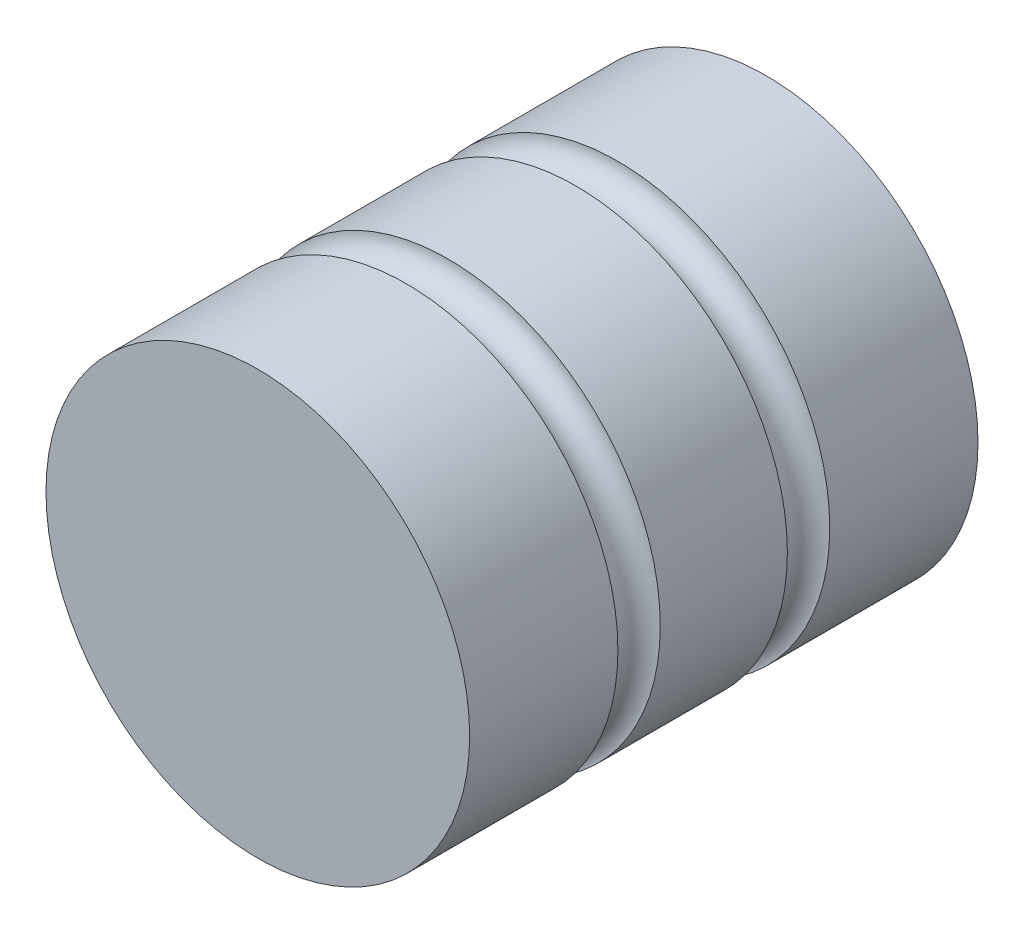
from build123d import *

# Parameters (mm, degrees)
SZKIC1_R                    = 50
DODANIE_WYCI_GNI_CIE1_DEPTH = 120


with BuildPart() as part:
    # Szkic1 → Dodanie-wyci_gni_cie1 (new body)
    with BuildSketch(Plane.XY):
        Circle(SZKIC1_R)
    extrude(amount=DODANIE_WYCI_GNI_CIE1_DEPTH)

    # Szkic2 → Wyci_cie-obr_t1 (revolve, cut)
    with BuildSketch(Plane(origin=(0, 0, 0), x_dir=(0, 0, -1), z_dir=(0.8722259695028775, 0.48910311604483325, 0)), mode=Mode.PRIVATE) as wyci_cie_obr_t1_sk:
        with BuildLine():
            Line((-75, 50), (-85, 50))
            ThreePointArc((-85, 50), (-80, 45), (-75, 50))
        make_face()
    revolve(wyci_cie_obr_t1_sk.sketch.rotate(Axis((0, 0, 91.964223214), (0, 0, -1)), 119.281649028), axis=Axis((0, 0, 91.964223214), (0, 0, -1)), mode=Mode.SUBTRACT)

    # Szkic24 → Wyci_cie-obr_t14 (revolve, cut)
    with BuildSketch(Plane(origin=(0, 0, 0), x_dir=(0, 0, -1), z_dir=(0.8722259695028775, 0.48910311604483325, 0)), mode=Mode.PRIVATE) as wyci_cie_obr_t14_sk:
        with BuildLine():
            Line((-35, 50), (-45, 50))
            ThreePointArc((-45, 50), (-40, 45), (-35, 50))
        make_face()
    revolve(wyci_cie_obr_t14_sk.sketch.rotate(Axis((0, 0, 91.964223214), (0, 0, -1)), 119.281649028), axis=Axis((0, 0, 91.964223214), (0, 0, -1)), mode=Mode.SUBTRACT)


solid = part.part
